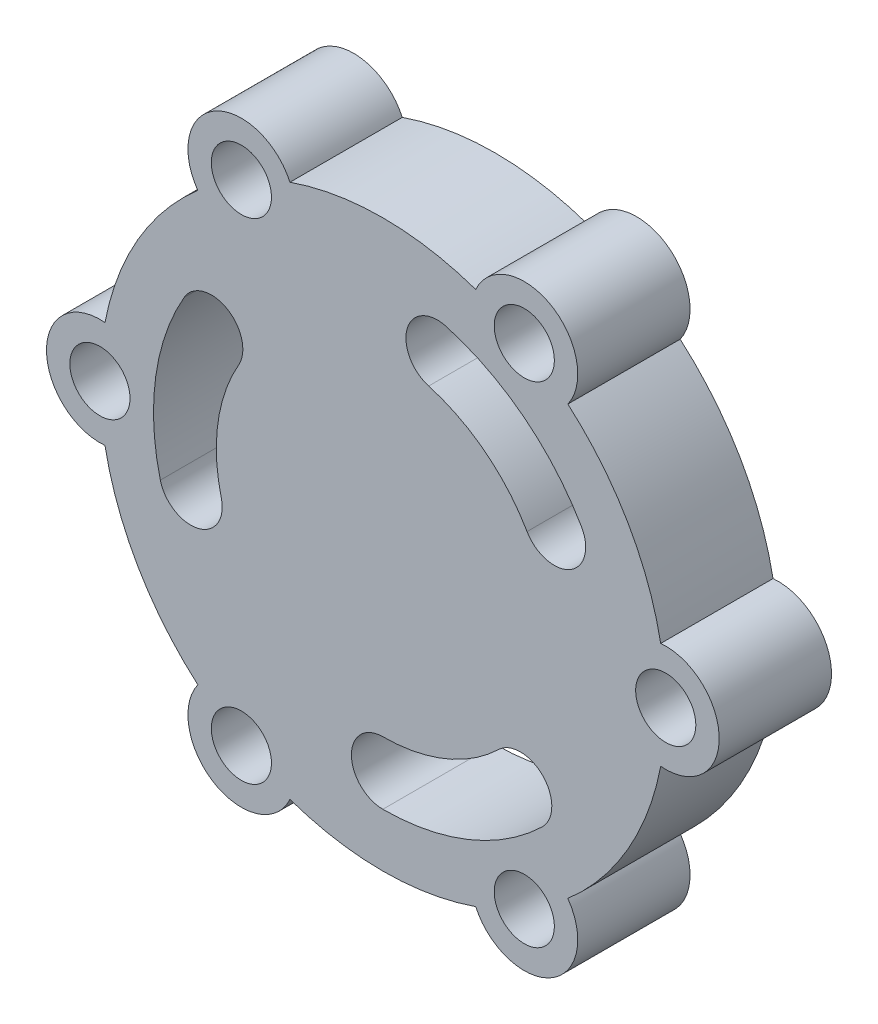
from build123d import *

# Parameters (mm, degrees)
SKETCH1_R           = 5.354465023
BOSS_EXTRUDE1_DEPTH = 20


with BuildPart() as part:
    # Sketch1 → Boss-Extrude1 (new body)
    with BuildSketch(Plane.XY):
        with BuildLine():
            ThreePointArc((49.475964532, 9.47170771), (43.62554567, 25.187220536), (32.94072176, 38.111588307))
            ThreePointArc((32.94072176, 38.111588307), (29.944333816, 51.865107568), (16.535242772, 47.583296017))
            ThreePointArc((16.535242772, 47.583296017), (0, 50.374441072), (-16.535242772, 47.583296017))
            ThreePointArc((-16.535242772, 47.583296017), (-29.944333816, 51.865107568), (-32.94072176, 38.111588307))
            ThreePointArc((-32.94072176, 38.111588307), (-43.62554567, 25.187220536), (-49.475964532, 9.47170771))
            ThreePointArc((-49.475964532, 9.47170771), (-59.888667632, 0), (-49.475964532, -9.47170771))
            ThreePointArc((-49.475964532, -9.47170771), (-43.62554567, -25.187220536), (-32.94072176, -38.111588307))
            ThreePointArc((-32.94072176, -38.111588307), (-29.944333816, -51.865107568), (-16.535242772, -47.583296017))
            ThreePointArc((-16.535242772, -47.583296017), (0, -50.374441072), (16.535242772, -47.583296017))
            ThreePointArc((16.535242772, -47.583296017), (29.944333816, -51.865107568), (32.94072176, -38.111588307))
            ThreePointArc((32.94072176, -38.111588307), (43.62554567, -25.187220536), (49.475964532, -9.47170771))
            ThreePointArc((49.475964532, -9.47170771), (59.888667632, 0), (49.475964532, 9.47170771))
        make_face()
        with Locations((50.374441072, 0)):
            Circle(SKETCH1_R, mode=Mode.SUBTRACT)
        with Locations((25.187220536, -43.62554567)):
            Circle(SKETCH1_R, mode=Mode.SUBTRACT)
        with Locations((-25.187220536, -43.62554567)):
            Circle(SKETCH1_R, mode=Mode.SUBTRACT)
        with Locations((-50.374441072, 0)):
            Circle(SKETCH1_R, mode=Mode.SUBTRACT)
        with Locations((-25.187220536, 43.62554567)):
            Circle(SKETCH1_R, mode=Mode.SUBTRACT)
        with Locations((25.187220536, 43.62554567)):
            Circle(SKETCH1_R, mode=Mode.SUBTRACT)
        with BuildLine():
            ThreePointArc((35.366855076, 20.419063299), (25.135956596, 32.185963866), (11.240644, 39.26067379))
            ThreePointArc((11.240644, 39.26067379), (4.322750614, 35.42236645), (8.161057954, 28.504473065))
            ThreePointArc((8.161057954, 28.504473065), (18.249488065, 23.368013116), (25.677439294, 14.824876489))
            ThreePointArc((25.677439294, 14.824876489), (33.31924059, 12.777262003), (35.366855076, 20.419063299))
        make_face(mode=Mode.SUBTRACT)
        with BuildLine():
            ThreePointArc((0, -40.838126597), (15.305884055, -37.861358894), (28.380418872, -29.365020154))
            ThreePointArc((28.380418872, -29.365020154), (28.515293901, -21.454795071), (20.605068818, -21.319920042))
            ThreePointArc((20.605068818, -21.319920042), (11.112548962, -27.488526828), (0, -29.649752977))
            ThreePointArc((0, -29.649752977), (-5.59418681, -35.243939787), (0, -40.838126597))
        make_face(mode=Mode.SUBTRACT)
        with BuildLine():
            ThreePointArc((-35.366855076, 20.419063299), (-40.441840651, 5.675395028), (-39.621062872, -9.895653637))
            ThreePointArc((-39.621062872, -9.895653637), (-32.838044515, -13.967571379), (-28.766126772, -7.184553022))
            ThreePointArc((-28.766126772, -7.184553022), (-29.362037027, 4.120513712), (-25.677439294, 14.824876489))
            ThreePointArc((-25.677439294, 14.824876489), (-27.72505378, 22.466677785), (-35.366855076, 20.419063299))
        make_face(mode=Mode.SUBTRACT)
    extrude(amount=BOSS_EXTRUDE1_DEPTH)


solid = part.part
